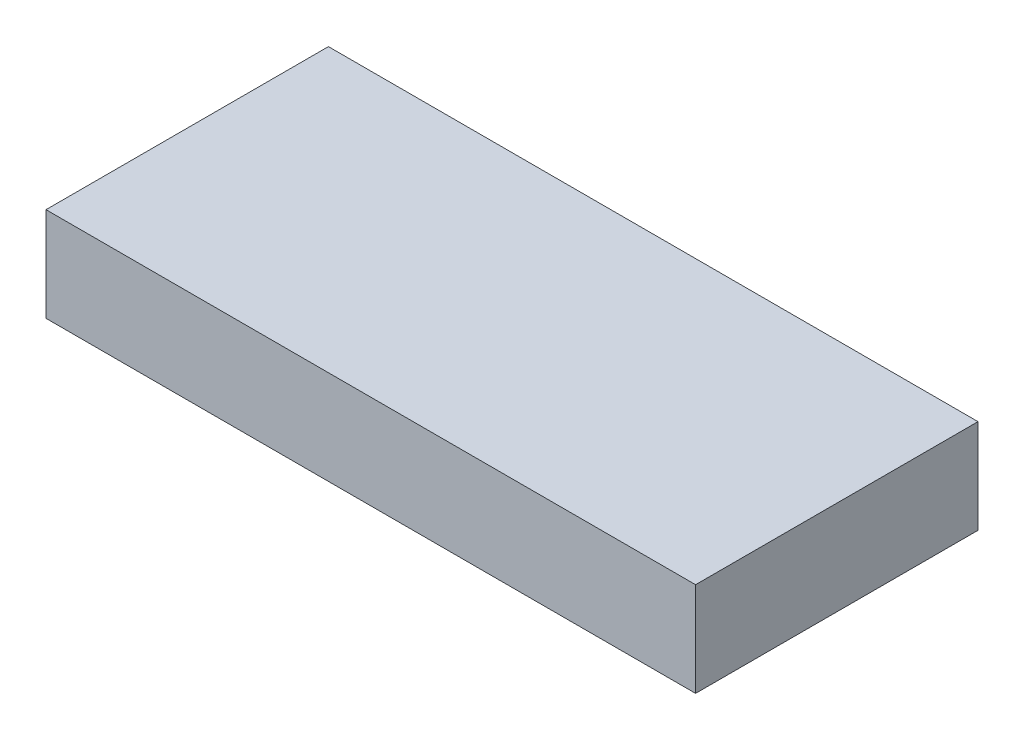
from build123d import *

# Parameters (mm, degrees)
SKETCH1_W      = 30
SKETCH1_H      = 10
EXTRUDE1_DEPTH = 69


with BuildPart() as part:
    # Sketch1 → Extrude1 (new body)
    with BuildSketch(Plane(origin=(0, 0, 0), x_dir=(0, 0, -1), z_dir=(1, 0, 0))):
        Rectangle(SKETCH1_W, SKETCH1_H)
    extrude(amount=EXTRUDE1_DEPTH)


solid = part.part
